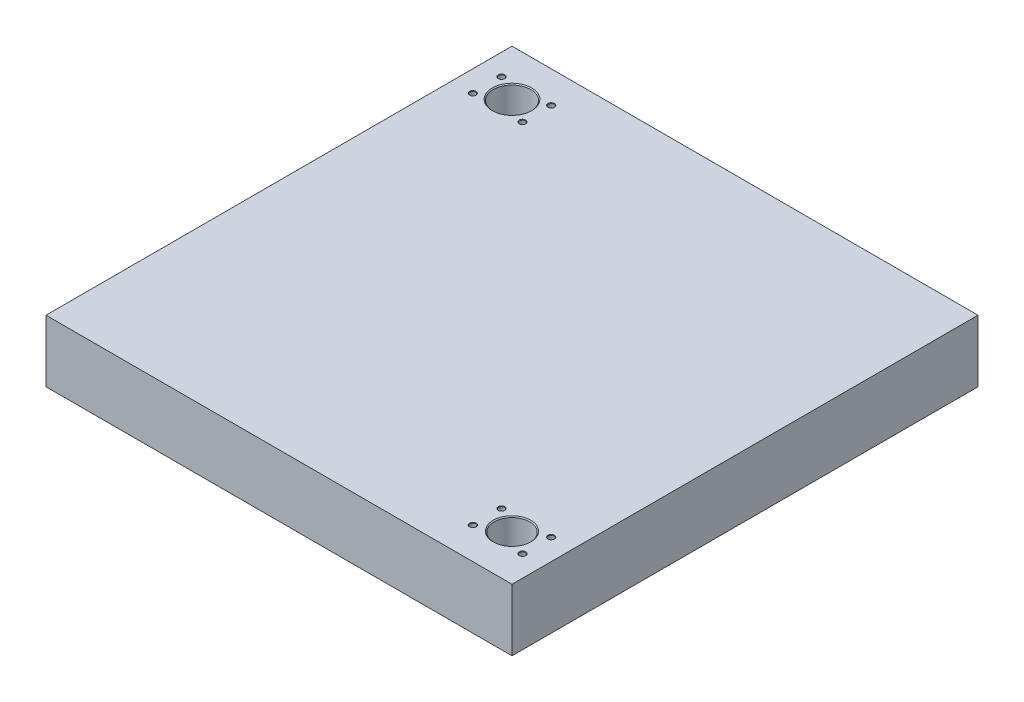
ISO-10303-21;
HEADER;
FILE_DESCRIPTION(('STEP AP214'),'2;1');
FILE_NAME('part.step','',(''),(''),'','','');
FILE_SCHEMA(('AUTOMOTIVE_DESIGN { 1 0 10303 214 1 1 1 1 }'));
ENDSEC;
DATA;
#1=APPLICATION_CONTEXT('core data for automotive mechanical design processes');
#2=APPLICATION_PROTOCOL_DEFINITION('international standard','automotive_design',2000,#1);
#3=PRODUCT_CONTEXT('',#1,'mechanical');
#4=PRODUCT('Part','Part','',(#3));
#5=PRODUCT_RELATED_PRODUCT_CATEGORY('part','',(#4));
#6=PRODUCT_DEFINITION_FORMATION('','',#4);
#7=PRODUCT_DEFINITION_CONTEXT('part definition',#1,'design');
#8=PRODUCT_DEFINITION('design','',#6,#7);
#9=PRODUCT_DEFINITION_SHAPE('','',#8);
#10=(LENGTH_UNIT() NAMED_UNIT(*) SI_UNIT(.MILLI.,.METRE.));
#11=(NAMED_UNIT(*) PLANE_ANGLE_UNIT() SI_UNIT($,.RADIAN.));
#12=(NAMED_UNIT(*) SI_UNIT($,.STERADIAN.) SOLID_ANGLE_UNIT());
#13=UNCERTAINTY_MEASURE_WITH_UNIT(LENGTH_MEASURE(1.E-05),#10,'distance_accuracy_value','');
#14=(GEOMETRIC_REPRESENTATION_CONTEXT(3) GLOBAL_UNCERTAINTY_ASSIGNED_CONTEXT((#13)) GLOBAL_UNIT_ASSIGNED_CONTEXT((#10,
#11,#12)) REPRESENTATION_CONTEXT('',''));
#15=CARTESIAN_POINT('',(0.,0.,0.));
#16=DIRECTION('',(0.,0.,1.));
#17=DIRECTION('',(1.,0.,0.));
#18=AXIS2_PLACEMENT_3D('',#15,#16,#17);
#19=CARTESIAN_POINT('',(0.,66.,0.));
#20=DIRECTION('',(0.,1.,0.));
#21=DIRECTION('',(0.,0.,1.));
#22=AXIS2_PLACEMENT_3D('',#19,#20,#21);
#23=PLANE('',#22);
#24=CARTESIAN_POINT('',(199.,66.,199.));
#25=DIRECTION('',(0.,1.,0.));
#26=DIRECTION('',(0.,0.,1.));
#27=AXIS2_PLACEMENT_3D('',#24,#25,#26);
#28=CIRCLE('',#27,20.);
#29=CARTESIAN_POINT('',(199.,66.,219.));
#30=VERTEX_POINT('',#29);
#31=EDGE_CURVE('E190',#30,#30,#28,.F.);
#32=ORIENTED_EDGE('',*,*,#31,.T.);
#33=EDGE_LOOP('',(#32));
#34=FACE_BOUND('',#33,.T.);
#35=CARTESIAN_POINT('',(-199.,66.,-199.));
#36=DIRECTION('',(0.,1.,0.));
#37=DIRECTION('',(0.,0.,1.));
#38=AXIS2_PLACEMENT_3D('',#35,#36,#37);
#39=CIRCLE('',#38,20.9999999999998);
#40=CARTESIAN_POINT('',(-199.,66.,-178.));
#41=VERTEX_POINT('',#40);
#42=EDGE_CURVE('E187',#41,#41,#39,.F.);
#43=ORIENTED_EDGE('',*,*,#42,.T.);
#44=EDGE_LOOP('',(#43));
#45=FACE_BOUND('',#44,.T.);
#46=CARTESIAN_POINT('',(-172.586225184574,66.,-183.75));
#47=DIRECTION('',(0.,1.,0.));
#48=DIRECTION('',(0.,0.,1.));
#49=AXIS2_PLACEMENT_3D('',#46,#47,#48);
#50=CIRCLE('',#49,3.49999999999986);
#51=CARTESIAN_POINT('',(-172.586225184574,66.,-180.25));
#52=VERTEX_POINT('',#51);
#53=EDGE_CURVE('E184',#52,#52,#50,.F.);
#54=ORIENTED_EDGE('',*,*,#53,.T.);
#55=EDGE_LOOP('',(#54));
#56=FACE_BOUND('',#55,.T.);
#57=CARTESIAN_POINT('',(-172.586225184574,66.,-214.25));
#58=DIRECTION('',(0.,1.,0.));
#59=DIRECTION('',(0.,0.,1.));
#60=AXIS2_PLACEMENT_3D('',#57,#58,#59);
#61=CIRCLE('',#60,3.49999999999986);
#62=CARTESIAN_POINT('',(-172.586225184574,66.,-210.75));
#63=VERTEX_POINT('',#62);
#64=EDGE_CURVE('E181',#63,#63,#61,.F.);
#65=ORIENTED_EDGE('',*,*,#64,.T.);
#66=EDGE_LOOP('',(#65));
#67=FACE_BOUND('',#66,.T.);
#68=CARTESIAN_POINT('',(-225.413774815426,66.,-183.75));
#69=DIRECTION('',(0.,1.,0.));
#70=DIRECTION('',(0.,0.,1.));
#71=AXIS2_PLACEMENT_3D('',#68,#69,#70);
#72=CIRCLE('',#71,3.49999999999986);
#73=CARTESIAN_POINT('',(-225.413774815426,66.,-180.25));
#74=VERTEX_POINT('',#73);
#75=EDGE_CURVE('E178',#74,#74,#72,.F.);
#76=ORIENTED_EDGE('',*,*,#75,.T.);
#77=EDGE_LOOP('',(#76));
#78=FACE_BOUND('',#77,.T.);
#79=CARTESIAN_POINT('',(-225.413774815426,66.,-214.25));
#80=DIRECTION('',(0.,1.,0.));
#81=DIRECTION('',(0.,0.,1.));
#82=AXIS2_PLACEMENT_3D('',#79,#80,#81);
#83=CIRCLE('',#82,3.49999999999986);
#84=CARTESIAN_POINT('',(-225.413774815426,66.,-210.75));
#85=VERTEX_POINT('',#84);
#86=EDGE_CURVE('E175',#85,#85,#83,.F.);
#87=ORIENTED_EDGE('',*,*,#86,.T.);
#88=EDGE_LOOP('',(#87));
#89=FACE_BOUND('',#88,.T.);
#90=CARTESIAN_POINT('',(172.586225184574,66.,214.25));
#91=DIRECTION('',(0.,1.,0.));
#92=DIRECTION('',(0.,0.,1.));
#93=AXIS2_PLACEMENT_3D('',#90,#91,#92);
#94=CIRCLE('',#93,3.49999999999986);
#95=CARTESIAN_POINT('',(172.586225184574,66.,217.75));
#96=VERTEX_POINT('',#95);
#97=EDGE_CURVE('E172',#96,#96,#94,.F.);
#98=ORIENTED_EDGE('',*,*,#97,.T.);
#99=EDGE_LOOP('',(#98));
#100=FACE_BOUND('',#99,.T.);
#101=CARTESIAN_POINT('',(225.413774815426,66.,214.25));
#102=DIRECTION('',(0.,1.,0.));
#103=DIRECTION('',(0.,0.,1.));
#104=AXIS2_PLACEMENT_3D('',#101,#102,#103);
#105=CIRCLE('',#104,3.49999999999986);
#106=CARTESIAN_POINT('',(225.413774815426,66.,217.75));
#107=VERTEX_POINT('',#106);
#108=EDGE_CURVE('E169',#107,#107,#105,.F.);
#109=ORIENTED_EDGE('',*,*,#108,.T.);
#110=EDGE_LOOP('',(#109));
#111=FACE_BOUND('',#110,.T.);
#112=CARTESIAN_POINT('',(225.413774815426,66.,183.75));
#113=DIRECTION('',(0.,1.,0.));
#114=DIRECTION('',(0.,0.,1.));
#115=AXIS2_PLACEMENT_3D('',#112,#113,#114);
#116=CIRCLE('',#115,3.49999999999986);
#117=CARTESIAN_POINT('',(225.413774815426,66.,187.25));
#118=VERTEX_POINT('',#117);
#119=EDGE_CURVE('E166',#118,#118,#116,.F.);
#120=ORIENTED_EDGE('',*,*,#119,.T.);
#121=EDGE_LOOP('',(#120));
#122=FACE_BOUND('',#121,.T.);
#123=CARTESIAN_POINT('',(172.586225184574,66.,183.75));
#124=DIRECTION('',(0.,1.,0.));
#125=DIRECTION('',(0.,0.,1.));
#126=AXIS2_PLACEMENT_3D('',#123,#124,#125);
#127=CIRCLE('',#126,3.49999999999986);
#128=CARTESIAN_POINT('',(172.586225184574,66.,187.25));
#129=VERTEX_POINT('',#128);
#130=EDGE_CURVE('E163',#129,#129,#127,.F.);
#131=ORIENTED_EDGE('',*,*,#130,.T.);
#132=EDGE_LOOP('',(#131));
#133=FACE_BOUND('',#132,.T.);
#134=DIRECTION('',(0.,0.,1.));
#135=VECTOR('',#134,1.);
#136=CARTESIAN_POINT('',(-248.,66.,248.));
#137=LINE('',#136,#135);
#138=CARTESIAN_POINT('',(-248.,66.,-248.));
#139=VERTEX_POINT('',#138);
#140=CARTESIAN_POINT('',(-248.,66.,248.));
#141=VERTEX_POINT('',#140);
#142=EDGE_CURVE('E131',#139,#141,#137,.T.);
#143=ORIENTED_EDGE('',*,*,#142,.T.);
#144=DIRECTION('',(1.,0.,0.));
#145=VECTOR('',#144,1.);
#146=CARTESIAN_POINT('',(248.,66.,248.));
#147=LINE('',#146,#145);
#148=CARTESIAN_POINT('',(248.,66.,248.));
#149=VERTEX_POINT('',#148);
#150=EDGE_CURVE('E67',#141,#149,#147,.T.);
#151=ORIENTED_EDGE('',*,*,#150,.T.);
#152=DIRECTION('',(0.,0.,-1.));
#153=VECTOR('',#152,1.);
#154=CARTESIAN_POINT('',(248.,66.,248.));
#155=LINE('',#154,#153);
#156=CARTESIAN_POINT('',(248.,66.,-248.));
#157=VERTEX_POINT('',#156);
#158=EDGE_CURVE('E134',#149,#157,#155,.T.);
#159=ORIENTED_EDGE('',*,*,#158,.T.);
#160=DIRECTION('',(-1.,0.,0.));
#161=VECTOR('',#160,1.);
#162=CARTESIAN_POINT('',(248.,66.,-248.));
#163=LINE('',#162,#161);
#164=EDGE_CURVE('E35',#157,#139,#163,.T.);
#165=ORIENTED_EDGE('',*,*,#164,.T.);
#166=EDGE_LOOP('',(#143,#151,#159,#165));
#167=FACE_BOUND('',#166,.T.);
#168=ADVANCED_FACE('F16',(#34,#45,#56,#67,#78,#89,#100,#111,#122,#133,#167),#23,.T.);
#169=CARTESIAN_POINT('',(0.,0.,0.));
#170=DIRECTION('',(0.,1.,0.));
#171=DIRECTION('',(0.,0.,1.));
#172=AXIS2_PLACEMENT_3D('',#169,#170,#171);
#173=PLANE('',#172);
#174=CARTESIAN_POINT('',(199.,0.,199.));
#175=DIRECTION('',(0.,1.,0.));
#176=DIRECTION('',(0.,0.,1.));
#177=AXIS2_PLACEMENT_3D('',#174,#175,#176);
#178=CIRCLE('',#177,20.);
#179=CARTESIAN_POINT('',(199.,0.,219.));
#180=VERTEX_POINT('',#179);
#181=EDGE_CURVE('E154',#180,#180,#178,.T.);
#182=ORIENTED_EDGE('',*,*,#181,.T.);
#183=EDGE_LOOP('',(#182));
#184=FACE_BOUND('',#183,.T.);
#185=CARTESIAN_POINT('',(-199.,0.,-199.));
#186=DIRECTION('',(0.,1.,0.));
#187=DIRECTION('',(0.,0.,1.));
#188=AXIS2_PLACEMENT_3D('',#185,#186,#187);
#189=CIRCLE('',#188,21.);
#190=CARTESIAN_POINT('',(-199.,0.,-178.));
#191=VERTEX_POINT('',#190);
#192=EDGE_CURVE('E151',#191,#191,#189,.T.);
#193=ORIENTED_EDGE('',*,*,#192,.T.);
#194=EDGE_LOOP('',(#193));
#195=FACE_BOUND('',#194,.T.);
#196=DIRECTION('',(0.,0.,1.));
#197=VECTOR('',#196,1.);
#198=CARTESIAN_POINT('',(-248.,0.,248.));
#199=LINE('',#198,#197);
#200=CARTESIAN_POINT('',(-248.,0.,-248.));
#201=VERTEX_POINT('',#200);
#202=CARTESIAN_POINT('',(-248.,0.,248.));
#203=VERTEX_POINT('',#202);
#204=EDGE_CURVE('E130',#201,#203,#199,.T.);
#205=ORIENTED_EDGE('',*,*,#204,.F.);
#206=DIRECTION('',(-1.,0.,0.));
#207=VECTOR('',#206,1.);
#208=CARTESIAN_POINT('',(248.,0.,-248.));
#209=LINE('',#208,#207);
#210=CARTESIAN_POINT('',(248.,0.,-248.));
#211=VERTEX_POINT('',#210);
#212=EDGE_CURVE('E59',#211,#201,#209,.T.);
#213=ORIENTED_EDGE('',*,*,#212,.F.);
#214=DIRECTION('',(0.,0.,-1.));
#215=VECTOR('',#214,1.);
#216=CARTESIAN_POINT('',(248.,0.,248.));
#217=LINE('',#216,#215);
#218=CARTESIAN_POINT('',(248.,0.,248.));
#219=VERTEX_POINT('',#218);
#220=EDGE_CURVE('E53',#219,#211,#217,.T.);
#221=ORIENTED_EDGE('',*,*,#220,.F.);
#222=DIRECTION('',(1.,0.,0.));
#223=VECTOR('',#222,1.);
#224=CARTESIAN_POINT('',(248.,0.,248.));
#225=LINE('',#224,#223);
#226=EDGE_CURVE('E140',#203,#219,#225,.T.);
#227=ORIENTED_EDGE('',*,*,#226,.F.);
#228=EDGE_LOOP('',(#205,#213,#221,#227));
#229=FACE_BOUND('',#228,.T.);
#230=ADVANCED_FACE('F262',(#184,#195,#229),#173,.F.);
#231=CARTESIAN_POINT('',(-248.,66.,248.));
#232=DIRECTION('',(1.,0.,0.));
#233=DIRECTION('',(0.,0.,-1.));
#234=AXIS2_PLACEMENT_3D('',#231,#232,#233);
#235=PLANE('',#234);
#236=ORIENTED_EDGE('',*,*,#204,.T.);
#237=DIRECTION('',(0.,-1.,0.));
#238=VECTOR('',#237,1.);
#239=CARTESIAN_POINT('',(-248.,66.,248.));
#240=LINE('',#239,#238);
#241=EDGE_CURVE('E149',#141,#203,#240,.T.);
#242=ORIENTED_EDGE('',*,*,#241,.F.);
#243=ORIENTED_EDGE('',*,*,#142,.F.);
#244=DIRECTION('',(0.,-1.,0.));
#245=VECTOR('',#244,1.);
#246=CARTESIAN_POINT('',(-248.,66.,-248.));
#247=LINE('',#246,#245);
#248=EDGE_CURVE('E137',#139,#201,#247,.T.);
#249=ORIENTED_EDGE('',*,*,#248,.T.);
#250=EDGE_LOOP('',(#236,#242,#243,#249));
#251=FACE_BOUND('',#250,.T.);
#252=ADVANCED_FACE('F269',(#251),#235,.F.);
#253=CARTESIAN_POINT('',(248.,66.,248.));
#254=DIRECTION('',(0.,0.,-1.));
#255=DIRECTION('',(-1.,0.,0.));
#256=AXIS2_PLACEMENT_3D('',#253,#254,#255);
#257=PLANE('',#256);
#258=ORIENTED_EDGE('',*,*,#226,.T.);
#259=DIRECTION('',(0.,-1.,0.));
#260=VECTOR('',#259,1.);
#261=CARTESIAN_POINT('',(248.,66.,248.));
#262=LINE('',#261,#260);
#263=EDGE_CURVE('E147',#149,#219,#262,.T.);
#264=ORIENTED_EDGE('',*,*,#263,.F.);
#265=ORIENTED_EDGE('',*,*,#150,.F.);
#266=ORIENTED_EDGE('',*,*,#241,.T.);
#267=EDGE_LOOP('',(#258,#264,#265,#266));
#268=FACE_BOUND('',#267,.T.);
#269=ADVANCED_FACE('F283',(#268),#257,.F.);
#270=CARTESIAN_POINT('',(248.,66.,248.));
#271=DIRECTION('',(-1.,0.,0.));
#272=DIRECTION('',(0.,0.,1.));
#273=AXIS2_PLACEMENT_3D('',#270,#271,#272);
#274=PLANE('',#273);
#275=ORIENTED_EDGE('',*,*,#220,.T.);
#276=DIRECTION('',(0.,-1.,0.));
#277=VECTOR('',#276,1.);
#278=CARTESIAN_POINT('',(248.,66.,-248.));
#279=LINE('',#278,#277);
#280=EDGE_CURVE('E145',#157,#211,#279,.T.);
#281=ORIENTED_EDGE('',*,*,#280,.F.);
#282=ORIENTED_EDGE('',*,*,#158,.F.);
#283=ORIENTED_EDGE('',*,*,#263,.T.);
#284=EDGE_LOOP('',(#275,#281,#282,#283));
#285=FACE_BOUND('',#284,.T.);
#286=ADVANCED_FACE('F280',(#285),#274,.F.);
#287=CARTESIAN_POINT('',(248.,66.,-248.));
#288=DIRECTION('',(0.,0.,1.));
#289=DIRECTION('',(1.,0.,0.));
#290=AXIS2_PLACEMENT_3D('',#287,#288,#289);
#291=PLANE('',#290);
#292=ORIENTED_EDGE('',*,*,#212,.T.);
#293=ORIENTED_EDGE('',*,*,#248,.F.);
#294=ORIENTED_EDGE('',*,*,#164,.F.);
#295=ORIENTED_EDGE('',*,*,#280,.T.);
#296=EDGE_LOOP('',(#292,#293,#294,#295));
#297=FACE_BOUND('',#296,.T.);
#298=ADVANCED_FACE('F277',(#297),#291,.F.);
#299=CARTESIAN_POINT('',(-199.,66.,-199.));
#300=DIRECTION('',(0.,-1.,0.));
#301=DIRECTION('',(0.,0.,-1.));
#302=AXIS2_PLACEMENT_3D('',#299,#300,#301);
#303=CYLINDRICAL_SURFACE('',#302,20.);
#304=CARTESIAN_POINT('',(-199.,0.999999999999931,-199.));
#305=DIRECTION('',(0.,1.,0.));
#306=DIRECTION('',(0.,0.,1.));
#307=AXIS2_PLACEMENT_3D('',#304,#305,#306);
#308=CIRCLE('',#307,20.);
#309=CARTESIAN_POINT('',(-199.,0.999999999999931,-179.));
#310=VERTEX_POINT('',#309);
#311=EDGE_CURVE('E10',#310,#310,#308,.F.);
#312=ORIENTED_EDGE('',*,*,#311,.T.);
#313=EDGE_LOOP('',(#312));
#314=FACE_BOUND('',#313,.T.);
#315=CARTESIAN_POINT('',(-199.,65.,-199.));
#316=DIRECTION('',(0.,1.,0.));
#317=DIRECTION('',(0.,0.,1.));
#318=AXIS2_PLACEMENT_3D('',#315,#316,#317);
#319=CIRCLE('',#318,20.);
#320=CARTESIAN_POINT('',(-199.,65.,-179.));
#321=VERTEX_POINT('',#320);
#322=EDGE_CURVE('E26',#321,#321,#319,.T.);
#323=ORIENTED_EDGE('',*,*,#322,.T.);
#324=EDGE_LOOP('',(#323));
#325=FACE_BOUND('',#324,.T.);
#326=ADVANCED_FACE('F274',(#314,#325),#303,.F.);
#327=CARTESIAN_POINT('',(199.,66.,199.));
#328=DIRECTION('',(0.,-1.,0.));
#329=DIRECTION('',(0.,0.,-1.));
#330=AXIS2_PLACEMENT_3D('',#327,#328,#329);
#331=CYLINDRICAL_SURFACE('',#330,19.);
#332=CARTESIAN_POINT('',(199.,0.999999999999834,199.));
#333=DIRECTION('',(0.,1.,0.));
#334=DIRECTION('',(0.,0.,1.));
#335=AXIS2_PLACEMENT_3D('',#332,#333,#334);
#336=CIRCLE('',#335,19.);
#337=CARTESIAN_POINT('',(199.,0.999999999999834,218.));
#338=VERTEX_POINT('',#337);
#339=EDGE_CURVE('E160',#338,#338,#336,.F.);
#340=ORIENTED_EDGE('',*,*,#339,.T.);
#341=EDGE_LOOP('',(#340));
#342=FACE_BOUND('',#341,.T.);
#343=CARTESIAN_POINT('',(199.,65.,199.));
#344=DIRECTION('',(0.,1.,0.));
#345=DIRECTION('',(0.,0.,1.));
#346=AXIS2_PLACEMENT_3D('',#343,#344,#345);
#347=CIRCLE('',#346,19.);
#348=CARTESIAN_POINT('',(199.,65.,218.));
#349=VERTEX_POINT('',#348);
#350=EDGE_CURVE('E157',#349,#349,#347,.T.);
#351=ORIENTED_EDGE('',*,*,#350,.T.);
#352=EDGE_LOOP('',(#351));
#353=FACE_BOUND('',#352,.T.);
#354=ADVANCED_FACE('F293',(#342,#353),#331,.F.);
#355=CARTESIAN_POINT('',(199.,0.,199.));
#356=DIRECTION('',(0.,-1.,0.));
#357=DIRECTION('',(0.,0.,-1.));
#358=AXIS2_PLACEMENT_3D('',#355,#356,#357);
#359=CONICAL_SURFACE('',#358,20.,0.785398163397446);
#360=ORIENTED_EDGE('',*,*,#339,.F.);
#361=EDGE_LOOP('',(#360));
#362=FACE_BOUND('',#361,.T.);
#363=ORIENTED_EDGE('',*,*,#181,.F.);
#364=EDGE_LOOP('',(#363));
#365=FACE_BOUND('',#364,.T.);
#366=ADVANCED_FACE('F289',(#362,#365),#359,.F.);
#367=CARTESIAN_POINT('',(199.,65.,199.));
#368=DIRECTION('',(0.,1.,0.));
#369=DIRECTION('',(0.,0.,1.));
#370=AXIS2_PLACEMENT_3D('',#367,#368,#369);
#371=CONICAL_SURFACE('',#370,19.,0.785398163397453);
#372=ORIENTED_EDGE('',*,*,#31,.F.);
#373=EDGE_LOOP('',(#372));
#374=FACE_BOUND('',#373,.T.);
#375=ORIENTED_EDGE('',*,*,#350,.F.);
#376=EDGE_LOOP('',(#375));
#377=FACE_BOUND('',#376,.T.);
#378=ADVANCED_FACE('F292',(#374,#377),#371,.F.);
#379=CARTESIAN_POINT('',(-199.,0.,-199.));
#380=DIRECTION('',(0.,-1.,0.));
#381=DIRECTION('',(0.,0.,-1.));
#382=AXIS2_PLACEMENT_3D('',#379,#380,#381);
#383=CONICAL_SURFACE('',#382,21.,0.785398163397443);
#384=ORIENTED_EDGE('',*,*,#311,.F.);
#385=EDGE_LOOP('',(#384));
#386=FACE_BOUND('',#385,.T.);
#387=ORIENTED_EDGE('',*,*,#192,.F.);
#388=EDGE_LOOP('',(#387));
#389=FACE_BOUND('',#388,.T.);
#390=ADVANCED_FACE('F297',(#386,#389),#383,.F.);
#391=CARTESIAN_POINT('',(-199.,65.,-199.));
#392=DIRECTION('',(0.,1.,0.));
#393=DIRECTION('',(0.,0.,1.));
#394=AXIS2_PLACEMENT_3D('',#391,#392,#393);
#395=CONICAL_SURFACE('',#394,20.,0.785398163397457);
#396=ORIENTED_EDGE('',*,*,#42,.F.);
#397=EDGE_LOOP('',(#396));
#398=FACE_BOUND('',#397,.T.);
#399=ORIENTED_EDGE('',*,*,#322,.F.);
#400=EDGE_LOOP('',(#399));
#401=FACE_BOUND('',#400,.T.);
#402=ADVANCED_FACE('F301',(#398,#401),#395,.F.);
#403=CARTESIAN_POINT('',(-172.586225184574,65.,-183.75));
#404=DIRECTION('',(0.,1.,0.));
#405=DIRECTION('',(0.,0.,1.));
#406=AXIS2_PLACEMENT_3D('',#403,#404,#405);
#407=CONICAL_SURFACE('',#406,2.5,0.785398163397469);
#408=CARTESIAN_POINT('',(-172.586225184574,65.5,-183.75));
#409=DIRECTION('',(0.,1.,0.));
#410=DIRECTION('',(0.,0.,1.));
#411=AXIS2_PLACEMENT_3D('',#408,#409,#410);
#412=CIRCLE('',#411,3.);
#413=CARTESIAN_POINT('',(-172.586225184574,65.5,-180.75));
#414=VERTEX_POINT('',#413);
#415=EDGE_CURVE('E216',#414,#414,#412,.T.);
#416=ORIENTED_EDGE('',*,*,#415,.F.);
#417=EDGE_LOOP('',(#416));
#418=FACE_BOUND('',#417,.T.);
#419=ORIENTED_EDGE('',*,*,#53,.F.);
#420=EDGE_LOOP('',(#419));
#421=FACE_BOUND('',#420,.T.);
#422=ADVANCED_FACE('F305',(#418,#421),#407,.F.);
#423=CARTESIAN_POINT('',(-172.586225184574,65.,-214.25));
#424=DIRECTION('',(0.,1.,0.));
#425=DIRECTION('',(0.,0.,1.));
#426=AXIS2_PLACEMENT_3D('',#423,#424,#425);
#427=CONICAL_SURFACE('',#426,2.5,0.785398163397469);
#428=CARTESIAN_POINT('',(-172.586225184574,65.5,-214.25));
#429=DIRECTION('',(0.,1.,0.));
#430=DIRECTION('',(0.,0.,1.));
#431=AXIS2_PLACEMENT_3D('',#428,#429,#430);
#432=CIRCLE('',#431,3.);
#433=CARTESIAN_POINT('',(-172.586225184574,65.5,-211.25));
#434=VERTEX_POINT('',#433);
#435=EDGE_CURVE('E213',#434,#434,#432,.T.);
#436=ORIENTED_EDGE('',*,*,#435,.F.);
#437=EDGE_LOOP('',(#436));
#438=FACE_BOUND('',#437,.T.);
#439=ORIENTED_EDGE('',*,*,#64,.F.);
#440=EDGE_LOOP('',(#439));
#441=FACE_BOUND('',#440,.T.);
#442=ADVANCED_FACE('F309',(#438,#441),#427,.F.);
#443=CARTESIAN_POINT('',(-225.413774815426,65.,-183.75));
#444=DIRECTION('',(0.,1.,0.));
#445=DIRECTION('',(0.,0.,1.));
#446=AXIS2_PLACEMENT_3D('',#443,#444,#445);
#447=CONICAL_SURFACE('',#446,2.5,0.785398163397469);
#448=CARTESIAN_POINT('',(-225.413774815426,65.5,-183.75));
#449=DIRECTION('',(0.,1.,0.));
#450=DIRECTION('',(0.,0.,1.));
#451=AXIS2_PLACEMENT_3D('',#448,#449,#450);
#452=CIRCLE('',#451,3.);
#453=CARTESIAN_POINT('',(-225.413774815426,65.5,-180.75));
#454=VERTEX_POINT('',#453);
#455=EDGE_CURVE('E210',#454,#454,#452,.T.);
#456=ORIENTED_EDGE('',*,*,#455,.F.);
#457=EDGE_LOOP('',(#456));
#458=FACE_BOUND('',#457,.T.);
#459=ORIENTED_EDGE('',*,*,#75,.F.);
#460=EDGE_LOOP('',(#459));
#461=FACE_BOUND('',#460,.T.);
#462=ADVANCED_FACE('F313',(#458,#461),#447,.F.);
#463=CARTESIAN_POINT('',(-225.413774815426,65.,-214.25));
#464=DIRECTION('',(0.,1.,0.));
#465=DIRECTION('',(0.,0.,1.));
#466=AXIS2_PLACEMENT_3D('',#463,#464,#465);
#467=CONICAL_SURFACE('',#466,2.5,0.785398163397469);
#468=CARTESIAN_POINT('',(-225.413774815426,65.5,-214.25));
#469=DIRECTION('',(0.,1.,0.));
#470=DIRECTION('',(0.,0.,1.));
#471=AXIS2_PLACEMENT_3D('',#468,#469,#470);
#472=CIRCLE('',#471,3.);
#473=CARTESIAN_POINT('',(-225.413774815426,65.5,-211.25));
#474=VERTEX_POINT('',#473);
#475=EDGE_CURVE('E207',#474,#474,#472,.T.);
#476=ORIENTED_EDGE('',*,*,#475,.F.);
#477=EDGE_LOOP('',(#476));
#478=FACE_BOUND('',#477,.T.);
#479=ORIENTED_EDGE('',*,*,#86,.F.);
#480=EDGE_LOOP('',(#479));
#481=FACE_BOUND('',#480,.T.);
#482=ADVANCED_FACE('F317',(#478,#481),#467,.F.);
#483=CARTESIAN_POINT('',(172.586225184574,65.,214.25));
#484=DIRECTION('',(0.,1.,0.));
#485=DIRECTION('',(0.,0.,1.));
#486=AXIS2_PLACEMENT_3D('',#483,#484,#485);
#487=CONICAL_SURFACE('',#486,2.5,0.785398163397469);
#488=CARTESIAN_POINT('',(172.586225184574,65.5,214.25));
#489=DIRECTION('',(0.,1.,0.));
#490=DIRECTION('',(0.,0.,1.));
#491=AXIS2_PLACEMENT_3D('',#488,#489,#490);
#492=CIRCLE('',#491,3.);
#493=CARTESIAN_POINT('',(172.586225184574,65.5,217.25));
#494=VERTEX_POINT('',#493);
#495=EDGE_CURVE('E204',#494,#494,#492,.T.);
#496=ORIENTED_EDGE('',*,*,#495,.F.);
#497=EDGE_LOOP('',(#496));
#498=FACE_BOUND('',#497,.T.);
#499=ORIENTED_EDGE('',*,*,#97,.F.);
#500=EDGE_LOOP('',(#499));
#501=FACE_BOUND('',#500,.T.);
#502=ADVANCED_FACE('F321',(#498,#501),#487,.F.);
#503=CARTESIAN_POINT('',(225.413774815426,65.,214.25));
#504=DIRECTION('',(0.,1.,0.));
#505=DIRECTION('',(0.,0.,1.));
#506=AXIS2_PLACEMENT_3D('',#503,#504,#505);
#507=CONICAL_SURFACE('',#506,2.5,0.785398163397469);
#508=CARTESIAN_POINT('',(225.413774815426,65.5,214.25));
#509=DIRECTION('',(0.,1.,0.));
#510=DIRECTION('',(0.,0.,1.));
#511=AXIS2_PLACEMENT_3D('',#508,#509,#510);
#512=CIRCLE('',#511,3.);
#513=CARTESIAN_POINT('',(225.413774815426,65.5,217.25));
#514=VERTEX_POINT('',#513);
#515=EDGE_CURVE('E201',#514,#514,#512,.T.);
#516=ORIENTED_EDGE('',*,*,#515,.F.);
#517=EDGE_LOOP('',(#516));
#518=FACE_BOUND('',#517,.T.);
#519=ORIENTED_EDGE('',*,*,#108,.F.);
#520=EDGE_LOOP('',(#519));
#521=FACE_BOUND('',#520,.T.);
#522=ADVANCED_FACE('F325',(#518,#521),#507,.F.);
#523=CARTESIAN_POINT('',(225.413774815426,65.,183.75));
#524=DIRECTION('',(0.,1.,0.));
#525=DIRECTION('',(0.,0.,1.));
#526=AXIS2_PLACEMENT_3D('',#523,#524,#525);
#527=CONICAL_SURFACE('',#526,2.5,0.785398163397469);
#528=CARTESIAN_POINT('',(225.413774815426,65.5,183.75));
#529=DIRECTION('',(0.,1.,0.));
#530=DIRECTION('',(0.,0.,1.));
#531=AXIS2_PLACEMENT_3D('',#528,#529,#530);
#532=CIRCLE('',#531,3.);
#533=CARTESIAN_POINT('',(225.413774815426,65.5,186.75));
#534=VERTEX_POINT('',#533);
#535=EDGE_CURVE('E198',#534,#534,#532,.T.);
#536=ORIENTED_EDGE('',*,*,#535,.F.);
#537=EDGE_LOOP('',(#536));
#538=FACE_BOUND('',#537,.T.);
#539=ORIENTED_EDGE('',*,*,#119,.F.);
#540=EDGE_LOOP('',(#539));
#541=FACE_BOUND('',#540,.T.);
#542=ADVANCED_FACE('F328',(#538,#541),#527,.F.);
#543=CARTESIAN_POINT('',(172.586225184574,65.,183.75));
#544=DIRECTION('',(0.,1.,0.));
#545=DIRECTION('',(0.,0.,1.));
#546=AXIS2_PLACEMENT_3D('',#543,#544,#545);
#547=CONICAL_SURFACE('',#546,2.5,0.785398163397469);
#548=CARTESIAN_POINT('',(172.586225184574,65.5,183.75));
#549=DIRECTION('',(0.,1.,0.));
#550=DIRECTION('',(0.,0.,1.));
#551=AXIS2_PLACEMENT_3D('',#548,#549,#550);
#552=CIRCLE('',#551,3.);
#553=CARTESIAN_POINT('',(172.586225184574,65.5,186.75));
#554=VERTEX_POINT('',#553);
#555=EDGE_CURVE('E195',#554,#554,#552,.T.);
#556=ORIENTED_EDGE('',*,*,#555,.F.);
#557=EDGE_LOOP('',(#556));
#558=FACE_BOUND('',#557,.T.);
#559=ORIENTED_EDGE('',*,*,#130,.F.);
#560=EDGE_LOOP('',(#559));
#561=FACE_BOUND('',#560,.T.);
#562=ADVANCED_FACE('F18',(#558,#561),#547,.F.);
#563=CARTESIAN_POINT('',(172.586225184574,51.,183.75));
#564=DIRECTION('',(0.,1.,0.));
#565=DIRECTION('',(0.,0.,1.));
#566=AXIS2_PLACEMENT_3D('',#563,#564,#565);
#567=PLANE('',#566);
#568=CARTESIAN_POINT('',(172.586225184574,51.,183.75));
#569=DIRECTION('',(0.,1.,0.));
#570=DIRECTION('',(0.,0.,1.));
#571=AXIS2_PLACEMENT_3D('',#568,#569,#570);
#572=CIRCLE('',#571,3.);
#573=CARTESIAN_POINT('',(172.586225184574,51.,186.75));
#574=VERTEX_POINT('',#573);
#575=EDGE_CURVE('E361',#574,#574,#572,.T.);
#576=ORIENTED_EDGE('',*,*,#575,.T.);
#577=EDGE_LOOP('',(#576));
#578=FACE_BOUND('',#577,.T.);
#579=CARTESIAN_POINT('',(172.586225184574,51.,183.75));
#580=DIRECTION('',(0.,1.,0.));
#581=DIRECTION('',(0.,0.,1.));
#582=AXIS2_PLACEMENT_3D('',#579,#580,#581);
#583=CIRCLE('',#582,2.5);
#584=CARTESIAN_POINT('',(172.586225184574,51.,186.25));
#585=VERTEX_POINT('',#584);
#586=EDGE_CURVE('E231',#585,#585,#583,.F.);
#587=ORIENTED_EDGE('',*,*,#586,.T.);
#588=EDGE_LOOP('',(#587));
#589=FACE_BOUND('',#588,.T.);
#590=ADVANCED_FACE('F336',(#578,#589),#567,.T.);
#591=CARTESIAN_POINT('',(172.586225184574,51.,183.75));
#592=DIRECTION('',(0.,1.,0.));
#593=DIRECTION('',(0.,0.,1.));
#594=AXIS2_PLACEMENT_3D('',#591,#592,#593);
#595=CYLINDRICAL_SURFACE('',#594,3.);
#596=ORIENTED_EDGE('',*,*,#555,.T.);
#597=EDGE_LOOP('',(#596));
#598=FACE_BOUND('',#597,.T.);
#599=ORIENTED_EDGE('',*,*,#575,.F.);
#600=EDGE_LOOP('',(#599));
#601=FACE_BOUND('',#600,.T.);
#602=ADVANCED_FACE('F412',(#598,#601),#595,.F.);
#603=CARTESIAN_POINT('',(225.413774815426,51.,183.75));
#604=DIRECTION('',(0.,1.,0.));
#605=DIRECTION('',(0.,0.,1.));
#606=AXIS2_PLACEMENT_3D('',#603,#604,#605);
#607=PLANE('',#606);
#608=CARTESIAN_POINT('',(225.413774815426,51.,183.75));
#609=DIRECTION('',(0.,1.,0.));
#610=DIRECTION('',(0.,0.,1.));
#611=AXIS2_PLACEMENT_3D('',#608,#609,#610);
#612=CIRCLE('',#611,3.);
#613=CARTESIAN_POINT('',(225.413774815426,51.,186.75));
#614=VERTEX_POINT('',#613);
#615=EDGE_CURVE('E358',#614,#614,#612,.T.);
#616=ORIENTED_EDGE('',*,*,#615,.T.);
#617=EDGE_LOOP('',(#616));
#618=FACE_BOUND('',#617,.T.);
#619=CARTESIAN_POINT('',(225.413774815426,51.,183.75));
#620=DIRECTION('',(0.,1.,0.));
#621=DIRECTION('',(0.,0.,1.));
#622=AXIS2_PLACEMENT_3D('',#619,#620,#621);
#623=CIRCLE('',#622,2.5);
#624=CARTESIAN_POINT('',(225.413774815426,51.,186.25));
#625=VERTEX_POINT('',#624);
#626=EDGE_CURVE('E234',#625,#625,#623,.F.);
#627=ORIENTED_EDGE('',*,*,#626,.T.);
#628=EDGE_LOOP('',(#627));
#629=FACE_BOUND('',#628,.T.);
#630=ADVANCED_FACE('F354',(#618,#629),#607,.T.);
#631=CARTESIAN_POINT('',(225.413774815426,51.,183.75));
#632=DIRECTION('',(0.,1.,0.));
#633=DIRECTION('',(0.,0.,1.));
#634=AXIS2_PLACEMENT_3D('',#631,#632,#633);
#635=CYLINDRICAL_SURFACE('',#634,3.);
#636=ORIENTED_EDGE('',*,*,#535,.T.);
#637=EDGE_LOOP('',(#636));
#638=FACE_BOUND('',#637,.T.);
#639=ORIENTED_EDGE('',*,*,#615,.F.);
#640=EDGE_LOOP('',(#639));
#641=FACE_BOUND('',#640,.T.);
#642=ADVANCED_FACE('F351',(#638,#641),#635,.F.);
#643=CARTESIAN_POINT('',(225.413774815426,51.,214.25));
#644=DIRECTION('',(0.,1.,0.));
#645=DIRECTION('',(0.,0.,1.));
#646=AXIS2_PLACEMENT_3D('',#643,#644,#645);
#647=PLANE('',#646);
#648=CARTESIAN_POINT('',(225.413774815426,51.,214.25));
#649=DIRECTION('',(0.,1.,0.));
#650=DIRECTION('',(0.,0.,1.));
#651=AXIS2_PLACEMENT_3D('',#648,#649,#650);
#652=CIRCLE('',#651,3.);
#653=CARTESIAN_POINT('',(225.413774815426,51.,217.25));
#654=VERTEX_POINT('',#653);
#655=EDGE_CURVE('E360',#654,#654,#652,.T.);
#656=ORIENTED_EDGE('',*,*,#655,.T.);
#657=EDGE_LOOP('',(#656));
#658=FACE_BOUND('',#657,.T.);
#659=CARTESIAN_POINT('',(225.413774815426,51.,214.25));
#660=DIRECTION('',(0.,1.,0.));
#661=DIRECTION('',(0.,0.,1.));
#662=AXIS2_PLACEMENT_3D('',#659,#660,#661);
#663=CIRCLE('',#662,2.5);
#664=CARTESIAN_POINT('',(225.413774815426,51.,216.75));
#665=VERTEX_POINT('',#664);
#666=EDGE_CURVE('E108',#665,#665,#663,.F.);
#667=ORIENTED_EDGE('',*,*,#666,.T.);
#668=EDGE_LOOP('',(#667));
#669=FACE_BOUND('',#668,.T.);
#670=ADVANCED_FACE('F239',(#658,#669),#647,.T.);
#671=CARTESIAN_POINT('',(225.413774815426,51.,214.25));
#672=DIRECTION('',(0.,1.,0.));
#673=DIRECTION('',(0.,0.,1.));
#674=AXIS2_PLACEMENT_3D('',#671,#672,#673);
#675=CYLINDRICAL_SURFACE('',#674,3.);
#676=ORIENTED_EDGE('',*,*,#515,.T.);
#677=EDGE_LOOP('',(#676));
#678=FACE_BOUND('',#677,.T.);
#679=ORIENTED_EDGE('',*,*,#655,.F.);
#680=EDGE_LOOP('',(#679));
#681=FACE_BOUND('',#680,.T.);
#682=ADVANCED_FACE('F405',(#678,#681),#675,.F.);
#683=CARTESIAN_POINT('',(172.586225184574,51.,214.25));
#684=DIRECTION('',(0.,1.,0.));
#685=DIRECTION('',(0.,0.,1.));
#686=AXIS2_PLACEMENT_3D('',#683,#684,#685);
#687=PLANE('',#686);
#688=CARTESIAN_POINT('',(172.586225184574,51.,214.25));
#689=DIRECTION('',(0.,1.,0.));
#690=DIRECTION('',(0.,0.,1.));
#691=AXIS2_PLACEMENT_3D('',#688,#689,#690);
#692=CIRCLE('',#691,3.);
#693=CARTESIAN_POINT('',(172.586225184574,51.,217.25));
#694=VERTEX_POINT('',#693);
#695=EDGE_CURVE('E110',#694,#694,#692,.T.);
#696=ORIENTED_EDGE('',*,*,#695,.T.);
#697=EDGE_LOOP('',(#696));
#698=FACE_BOUND('',#697,.T.);
#699=CARTESIAN_POINT('',(172.586225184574,51.,214.25));
#700=DIRECTION('',(0.,1.,0.));
#701=DIRECTION('',(0.,0.,1.));
#702=AXIS2_PLACEMENT_3D('',#699,#700,#701);
#703=CIRCLE('',#702,2.5);
#704=CARTESIAN_POINT('',(172.586225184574,51.,216.75));
#705=VERTEX_POINT('',#704);
#706=EDGE_CURVE('E20',#705,#705,#703,.F.);
#707=ORIENTED_EDGE('',*,*,#706,.T.);
#708=EDGE_LOOP('',(#707));
#709=FACE_BOUND('',#708,.T.);
#710=ADVANCED_FACE('F409',(#698,#709),#687,.T.);
#711=CARTESIAN_POINT('',(172.586225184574,51.,214.25));
#712=DIRECTION('',(0.,1.,0.));
#713=DIRECTION('',(0.,0.,1.));
#714=AXIS2_PLACEMENT_3D('',#711,#712,#713);
#715=CYLINDRICAL_SURFACE('',#714,3.);
#716=ORIENTED_EDGE('',*,*,#495,.T.);
#717=EDGE_LOOP('',(#716));
#718=FACE_BOUND('',#717,.T.);
#719=ORIENTED_EDGE('',*,*,#695,.F.);
#720=EDGE_LOOP('',(#719));
#721=FACE_BOUND('',#720,.T.);
#722=ADVANCED_FACE('F399',(#718,#721),#715,.F.);
#723=CARTESIAN_POINT('',(-225.413774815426,51.,-214.25));
#724=DIRECTION('',(0.,1.,0.));
#725=DIRECTION('',(0.,0.,1.));
#726=AXIS2_PLACEMENT_3D('',#723,#724,#725);
#727=PLANE('',#726);
#728=CARTESIAN_POINT('',(-225.413774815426,51.,-214.25));
#729=DIRECTION('',(0.,1.,0.));
#730=DIRECTION('',(0.,0.,1.));
#731=AXIS2_PLACEMENT_3D('',#728,#729,#730);
#732=CIRCLE('',#731,3.);
#733=CARTESIAN_POINT('',(-225.413774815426,51.,-211.25));
#734=VERTEX_POINT('',#733);
#735=EDGE_CURVE('E379',#734,#734,#732,.T.);
#736=ORIENTED_EDGE('',*,*,#735,.T.);
#737=EDGE_LOOP('',(#736));
#738=FACE_BOUND('',#737,.T.);
#739=CARTESIAN_POINT('',(-225.413774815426,51.,-214.25));
#740=DIRECTION('',(0.,1.,0.));
#741=DIRECTION('',(0.,0.,1.));
#742=AXIS2_PLACEMENT_3D('',#739,#740,#741);
#743=CIRCLE('',#742,2.5);
#744=CARTESIAN_POINT('',(-225.413774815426,51.,-211.75));
#745=VERTEX_POINT('',#744);
#746=EDGE_CURVE('E219',#745,#745,#743,.F.);
#747=ORIENTED_EDGE('',*,*,#746,.T.);
#748=EDGE_LOOP('',(#747));
#749=FACE_BOUND('',#748,.T.);
#750=ADVANCED_FACE('F384',(#738,#749),#727,.T.);
#751=CARTESIAN_POINT('',(-225.413774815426,51.,-214.25));
#752=DIRECTION('',(0.,1.,0.));
#753=DIRECTION('',(0.,0.,1.));
#754=AXIS2_PLACEMENT_3D('',#751,#752,#753);
#755=CYLINDRICAL_SURFACE('',#754,3.);
#756=ORIENTED_EDGE('',*,*,#475,.T.);
#757=EDGE_LOOP('',(#756));
#758=FACE_BOUND('',#757,.T.);
#759=ORIENTED_EDGE('',*,*,#735,.F.);
#760=EDGE_LOOP('',(#759));
#761=FACE_BOUND('',#760,.T.);
#762=ADVANCED_FACE('F387',(#758,#761),#755,.F.);
#763=CARTESIAN_POINT('',(-225.413774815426,51.,-183.75));
#764=DIRECTION('',(0.,1.,0.));
#765=DIRECTION('',(0.,0.,1.));
#766=AXIS2_PLACEMENT_3D('',#763,#764,#765);
#767=PLANE('',#766);
#768=CARTESIAN_POINT('',(-225.413774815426,51.,-183.75));
#769=DIRECTION('',(0.,1.,0.));
#770=DIRECTION('',(0.,0.,1.));
#771=AXIS2_PLACEMENT_3D('',#768,#769,#770);
#772=CIRCLE('',#771,3.);
#773=CARTESIAN_POINT('',(-225.413774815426,51.,-180.75));
#774=VERTEX_POINT('',#773);
#775=EDGE_CURVE('E366',#774,#774,#772,.T.);
#776=ORIENTED_EDGE('',*,*,#775,.T.);
#777=EDGE_LOOP('',(#776));
#778=FACE_BOUND('',#777,.T.);
#779=CARTESIAN_POINT('',(-225.413774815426,51.,-183.75));
#780=DIRECTION('',(0.,1.,0.));
#781=DIRECTION('',(0.,0.,1.));
#782=AXIS2_PLACEMENT_3D('',#779,#780,#781);
#783=CIRCLE('',#782,2.5);
#784=CARTESIAN_POINT('',(-225.413774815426,51.,-181.25));
#785=VERTEX_POINT('',#784);
#786=EDGE_CURVE('E228',#785,#785,#783,.F.);
#787=ORIENTED_EDGE('',*,*,#786,.T.);
#788=EDGE_LOOP('',(#787));
#789=FACE_BOUND('',#788,.T.);
#790=ADVANCED_FACE('F389',(#778,#789),#767,.T.);
#791=CARTESIAN_POINT('',(-225.413774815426,51.,-183.75));
#792=DIRECTION('',(0.,1.,0.));
#793=DIRECTION('',(0.,0.,1.));
#794=AXIS2_PLACEMENT_3D('',#791,#792,#793);
#795=CYLINDRICAL_SURFACE('',#794,3.);
#796=ORIENTED_EDGE('',*,*,#455,.T.);
#797=EDGE_LOOP('',(#796));
#798=FACE_BOUND('',#797,.T.);
#799=ORIENTED_EDGE('',*,*,#775,.F.);
#800=EDGE_LOOP('',(#799));
#801=FACE_BOUND('',#800,.T.);
#802=ADVANCED_FACE('F397',(#798,#801),#795,.F.);
#803=CARTESIAN_POINT('',(-172.586225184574,51.,-214.25));
#804=DIRECTION('',(0.,1.,0.));
#805=DIRECTION('',(0.,0.,1.));
#806=AXIS2_PLACEMENT_3D('',#803,#804,#805);
#807=PLANE('',#806);
#808=CARTESIAN_POINT('',(-172.586225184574,51.,-214.25));
#809=DIRECTION('',(0.,1.,0.));
#810=DIRECTION('',(0.,0.,1.));
#811=AXIS2_PLACEMENT_3D('',#808,#809,#810);
#812=CIRCLE('',#811,3.);
#813=CARTESIAN_POINT('',(-172.586225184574,51.,-211.25));
#814=VERTEX_POINT('',#813);
#815=EDGE_CURVE('E374',#814,#814,#812,.T.);
#816=ORIENTED_EDGE('',*,*,#815,.T.);
#817=EDGE_LOOP('',(#816));
#818=FACE_BOUND('',#817,.T.);
#819=CARTESIAN_POINT('',(-172.586225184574,51.,-214.25));
#820=DIRECTION('',(0.,1.,0.));
#821=DIRECTION('',(0.,0.,1.));
#822=AXIS2_PLACEMENT_3D('',#819,#820,#821);
#823=CIRCLE('',#822,2.5);
#824=CARTESIAN_POINT('',(-172.586225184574,51.,-211.75));
#825=VERTEX_POINT('',#824);
#826=EDGE_CURVE('E222',#825,#825,#823,.F.);
#827=ORIENTED_EDGE('',*,*,#826,.T.);
#828=EDGE_LOOP('',(#827));
#829=FACE_BOUND('',#828,.T.);
#830=ADVANCED_FACE('F422',(#818,#829),#807,.T.);
#831=CARTESIAN_POINT('',(-172.586225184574,51.,-214.25));
#832=DIRECTION('',(0.,1.,0.));
#833=DIRECTION('',(0.,0.,1.));
#834=AXIS2_PLACEMENT_3D('',#831,#832,#833);
#835=CYLINDRICAL_SURFACE('',#834,3.);
#836=ORIENTED_EDGE('',*,*,#435,.T.);
#837=EDGE_LOOP('',(#836));
#838=FACE_BOUND('',#837,.T.);
#839=ORIENTED_EDGE('',*,*,#815,.F.);
#840=EDGE_LOOP('',(#839));
#841=FACE_BOUND('',#840,.T.);
#842=ADVANCED_FACE('F755',(#838,#841),#835,.F.);
#843=CARTESIAN_POINT('',(-172.586225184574,51.,-183.75));
#844=DIRECTION('',(0.,1.,0.));
#845=DIRECTION('',(0.,0.,1.));
#846=AXIS2_PLACEMENT_3D('',#843,#844,#845);
#847=PLANE('',#846);
#848=CARTESIAN_POINT('',(-172.586225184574,51.,-183.75));
#849=DIRECTION('',(0.,1.,0.));
#850=DIRECTION('',(0.,0.,1.));
#851=AXIS2_PLACEMENT_3D('',#848,#849,#850);
#852=CIRCLE('',#851,3.);
#853=CARTESIAN_POINT('',(-172.586225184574,51.,-180.75));
#854=VERTEX_POINT('',#853);
#855=EDGE_CURVE('E370',#854,#854,#852,.T.);
#856=ORIENTED_EDGE('',*,*,#855,.T.);
#857=EDGE_LOOP('',(#856));
#858=FACE_BOUND('',#857,.T.);
#859=CARTESIAN_POINT('',(-172.586225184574,51.,-183.75));
#860=DIRECTION('',(0.,1.,0.));
#861=DIRECTION('',(0.,0.,1.));
#862=AXIS2_PLACEMENT_3D('',#859,#860,#861);
#863=CIRCLE('',#862,2.5);
#864=CARTESIAN_POINT('',(-172.586225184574,51.,-181.25));
#865=VERTEX_POINT('',#864);
#866=EDGE_CURVE('E225',#865,#865,#863,.F.);
#867=ORIENTED_EDGE('',*,*,#866,.T.);
#868=EDGE_LOOP('',(#867));
#869=FACE_BOUND('',#868,.T.);
#870=ADVANCED_FACE('F745',(#858,#869),#847,.T.);
#871=CARTESIAN_POINT('',(-172.586225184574,51.,-183.75));
#872=DIRECTION('',(0.,1.,0.));
#873=DIRECTION('',(0.,0.,1.));
#874=AXIS2_PLACEMENT_3D('',#871,#872,#873);
#875=CYLINDRICAL_SURFACE('',#874,3.);
#876=ORIENTED_EDGE('',*,*,#415,.T.);
#877=EDGE_LOOP('',(#876));
#878=FACE_BOUND('',#877,.T.);
#879=ORIENTED_EDGE('',*,*,#855,.F.);
#880=EDGE_LOOP('',(#879));
#881=FACE_BOUND('',#880,.T.);
#882=ADVANCED_FACE('F96',(#878,#881),#875,.F.);
#883=CARTESIAN_POINT('',(-225.413774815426,48.,-214.25));
#884=DIRECTION('',(0.,1.,0.));
#885=DIRECTION('',(0.,0.,1.));
#886=AXIS2_PLACEMENT_3D('',#883,#884,#885);
#887=CONICAL_SURFACE('',#886,2.49999999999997,1.02974425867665);
#888=CARTESIAN_POINT('',(-225.413774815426,46.4978484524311,-214.25));
#889=VERTEX_POINT('',#888);
#890=VERTEX_LOOP('',#889);
#891=FACE_BOUND('',#890,.T.);
#892=CARTESIAN_POINT('',(-225.413774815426,48.,-214.25));
#893=DIRECTION('',(0.,1.,0.));
#894=DIRECTION('',(0.,0.,1.));
#895=AXIS2_PLACEMENT_3D('',#892,#893,#894);
#896=CIRCLE('',#895,2.49999999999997);
#897=CARTESIAN_POINT('',(-225.413774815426,48.,-211.75));
#898=VERTEX_POINT('',#897);
#899=EDGE_CURVE('E100',#898,#898,#896,.T.);
#900=ORIENTED_EDGE('',*,*,#899,.T.);
#901=EDGE_LOOP('',(#900));
#902=FACE_BOUND('',#901,.T.);
#903=ADVANCED_FACE('F92',(#891,#902),#887,.F.);
#904=CARTESIAN_POINT('',(-225.413774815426,66.,-214.25));
#905=DIRECTION('',(0.,1.,0.));
#906=DIRECTION('',(0.,0.,1.));
#907=AXIS2_PLACEMENT_3D('',#904,#905,#906);
#908=CYLINDRICAL_SURFACE('',#907,2.5);
#909=ORIENTED_EDGE('',*,*,#899,.F.);
#910=EDGE_LOOP('',(#909));
#911=FACE_BOUND('',#910,.T.);
#912=ORIENTED_EDGE('',*,*,#746,.F.);
#913=EDGE_LOOP('',(#912));
#914=FACE_BOUND('',#913,.T.);
#915=ADVANCED_FACE('F95',(#911,#914),#908,.F.);
#916=CARTESIAN_POINT('',(-172.586225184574,48.,-214.25));
#917=DIRECTION('',(0.,1.,0.));
#918=DIRECTION('',(0.,0.,1.));
#919=AXIS2_PLACEMENT_3D('',#916,#917,#918);
#920=CONICAL_SURFACE('',#919,2.49999999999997,1.02974425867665);
#921=CARTESIAN_POINT('',(-172.586225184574,46.4978484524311,-214.25));
#922=VERTEX_POINT('',#921);
#923=VERTEX_LOOP('',#922);
#924=FACE_BOUND('',#923,.T.);
#925=CARTESIAN_POINT('',(-172.586225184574,48.,-214.25));
#926=DIRECTION('',(0.,1.,0.));
#927=DIRECTION('',(0.,0.,1.));
#928=AXIS2_PLACEMENT_3D('',#925,#926,#927);
#929=CIRCLE('',#928,2.49999999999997);
#930=CARTESIAN_POINT('',(-172.586225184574,48.,-211.75));
#931=VERTEX_POINT('',#930);
#932=EDGE_CURVE('E102',#931,#931,#929,.T.);
#933=ORIENTED_EDGE('',*,*,#932,.T.);
#934=EDGE_LOOP('',(#933));
#935=FACE_BOUND('',#934,.T.);
#936=ADVANCED_FACE('F431',(#924,#935),#920,.F.);
#937=CARTESIAN_POINT('',(-172.586225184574,66.,-214.25));
#938=DIRECTION('',(0.,1.,0.));
#939=DIRECTION('',(0.,0.,1.));
#940=AXIS2_PLACEMENT_3D('',#937,#938,#939);
#941=CYLINDRICAL_SURFACE('',#940,2.5);
#942=ORIENTED_EDGE('',*,*,#932,.F.);
#943=EDGE_LOOP('',(#942));
#944=FACE_BOUND('',#943,.T.);
#945=ORIENTED_EDGE('',*,*,#826,.F.);
#946=EDGE_LOOP('',(#945));
#947=FACE_BOUND('',#946,.T.);
#948=ADVANCED_FACE('F433',(#944,#947),#941,.F.);
#949=CARTESIAN_POINT('',(-172.586225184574,48.,-183.75));
#950=DIRECTION('',(0.,1.,0.));
#951=DIRECTION('',(0.,0.,1.));
#952=AXIS2_PLACEMENT_3D('',#949,#950,#951);
#953=CONICAL_SURFACE('',#952,2.49999999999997,1.02974425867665);
#954=CARTESIAN_POINT('',(-172.586225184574,46.4978484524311,-183.75));
#955=VERTEX_POINT('',#954);
#956=VERTEX_LOOP('',#955);
#957=FACE_BOUND('',#956,.T.);
#958=CARTESIAN_POINT('',(-172.586225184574,48.,-183.75));
#959=DIRECTION('',(0.,1.,0.));
#960=DIRECTION('',(0.,0.,1.));
#961=AXIS2_PLACEMENT_3D('',#958,#959,#960);
#962=CIRCLE('',#961,2.49999999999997);
#963=CARTESIAN_POINT('',(-172.586225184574,48.,-181.25));
#964=VERTEX_POINT('',#963);
#965=EDGE_CURVE('E105',#964,#964,#962,.T.);
#966=ORIENTED_EDGE('',*,*,#965,.T.);
#967=EDGE_LOOP('',(#966));
#968=FACE_BOUND('',#967,.T.);
#969=ADVANCED_FACE('F436',(#957,#968),#953,.F.);
#970=CARTESIAN_POINT('',(-172.586225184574,66.,-183.75));
#971=DIRECTION('',(0.,1.,0.));
#972=DIRECTION('',(0.,0.,1.));
#973=AXIS2_PLACEMENT_3D('',#970,#971,#972);
#974=CYLINDRICAL_SURFACE('',#973,2.5);
#975=ORIENTED_EDGE('',*,*,#965,.F.);
#976=EDGE_LOOP('',(#975));
#977=FACE_BOUND('',#976,.T.);
#978=ORIENTED_EDGE('',*,*,#866,.F.);
#979=EDGE_LOOP('',(#978));
#980=FACE_BOUND('',#979,.T.);
#981=ADVANCED_FACE('F441',(#977,#980),#974,.F.);
#982=CARTESIAN_POINT('',(-225.413774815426,48.,-183.75));
#983=DIRECTION('',(0.,1.,0.));
#984=DIRECTION('',(0.,0.,1.));
#985=AXIS2_PLACEMENT_3D('',#982,#983,#984);
#986=CONICAL_SURFACE('',#985,2.49999999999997,1.02974425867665);
#987=CARTESIAN_POINT('',(-225.413774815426,46.4978484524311,-183.75));
#988=VERTEX_POINT('',#987);
#989=VERTEX_LOOP('',#988);
#990=FACE_BOUND('',#989,.T.);
#991=CARTESIAN_POINT('',(-225.413774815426,48.,-183.75));
#992=DIRECTION('',(0.,1.,0.));
#993=DIRECTION('',(0.,0.,1.));
#994=AXIS2_PLACEMENT_3D('',#991,#992,#993);
#995=CIRCLE('',#994,2.49999999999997);
#996=CARTESIAN_POINT('',(-225.413774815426,48.,-181.25));
#997=VERTEX_POINT('',#996);
#998=EDGE_CURVE('E115',#997,#997,#995,.T.);
#999=ORIENTED_EDGE('',*,*,#998,.T.);
#1000=EDGE_LOOP('',(#999));
#1001=FACE_BOUND('',#1000,.T.);
#1002=ADVANCED_FACE('F444',(#990,#1001),#986,.F.);
#1003=CARTESIAN_POINT('',(-225.413774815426,66.,-183.75));
#1004=DIRECTION('',(0.,1.,0.));
#1005=DIRECTION('',(0.,0.,1.));
#1006=AXIS2_PLACEMENT_3D('',#1003,#1004,#1005);
#1007=CYLINDRICAL_SURFACE('',#1006,2.5);
#1008=ORIENTED_EDGE('',*,*,#998,.F.);
#1009=EDGE_LOOP('',(#1008));
#1010=FACE_BOUND('',#1009,.T.);
#1011=ORIENTED_EDGE('',*,*,#786,.F.);
#1012=EDGE_LOOP('',(#1011));
#1013=FACE_BOUND('',#1012,.T.);
#1014=ADVANCED_FACE('F449',(#1010,#1013),#1007,.F.);
#1015=CARTESIAN_POINT('',(172.586225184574,48.,183.75));
#1016=DIRECTION('',(0.,1.,0.));
#1017=DIRECTION('',(0.,0.,1.));
#1018=AXIS2_PLACEMENT_3D('',#1015,#1016,#1017);
#1019=CONICAL_SURFACE('',#1018,2.49999999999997,1.02974425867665);
#1020=CARTESIAN_POINT('',(172.586225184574,46.4978484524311,183.75));
#1021=VERTEX_POINT('',#1020);
#1022=VERTEX_LOOP('',#1021);
#1023=FACE_BOUND('',#1022,.T.);
#1024=CARTESIAN_POINT('',(172.586225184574,48.,183.75));
#1025=DIRECTION('',(0.,1.,0.));
#1026=DIRECTION('',(0.,0.,1.));
#1027=AXIS2_PLACEMENT_3D('',#1024,#1025,#1026);
#1028=CIRCLE('',#1027,2.49999999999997);
#1029=CARTESIAN_POINT('',(172.586225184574,48.,186.25));
#1030=VERTEX_POINT('',#1029);
#1031=EDGE_CURVE('E118',#1030,#1030,#1028,.T.);
#1032=ORIENTED_EDGE('',*,*,#1031,.T.);
#1033=EDGE_LOOP('',(#1032));
#1034=FACE_BOUND('',#1033,.T.);
#1035=ADVANCED_FACE('F452',(#1023,#1034),#1019,.F.);
#1036=CARTESIAN_POINT('',(172.586225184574,66.,183.75));
#1037=DIRECTION('',(0.,1.,0.));
#1038=DIRECTION('',(0.,0.,1.));
#1039=AXIS2_PLACEMENT_3D('',#1036,#1037,#1038);
#1040=CYLINDRICAL_SURFACE('',#1039,2.5);
#1041=ORIENTED_EDGE('',*,*,#1031,.F.);
#1042=EDGE_LOOP('',(#1041));
#1043=FACE_BOUND('',#1042,.T.);
#1044=ORIENTED_EDGE('',*,*,#586,.F.);
#1045=EDGE_LOOP('',(#1044));
#1046=FACE_BOUND('',#1045,.T.);
#1047=ADVANCED_FACE('F457',(#1043,#1046),#1040,.F.);
#1048=CARTESIAN_POINT('',(225.413774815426,48.,183.75));
#1049=DIRECTION('',(0.,1.,0.));
#1050=DIRECTION('',(0.,0.,1.));
#1051=AXIS2_PLACEMENT_3D('',#1048,#1049,#1050);
#1052=CONICAL_SURFACE('',#1051,2.49999999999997,1.02974425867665);
#1053=CARTESIAN_POINT('',(225.413774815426,46.4978484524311,183.75));
#1054=VERTEX_POINT('',#1053);
#1055=VERTEX_LOOP('',#1054);
#1056=FACE_BOUND('',#1055,.T.);
#1057=CARTESIAN_POINT('',(225.413774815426,48.,183.75));
#1058=DIRECTION('',(0.,1.,0.));
#1059=DIRECTION('',(0.,0.,1.));
#1060=AXIS2_PLACEMENT_3D('',#1057,#1058,#1059);
#1061=CIRCLE('',#1060,2.49999999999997);
#1062=CARTESIAN_POINT('',(225.413774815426,48.,186.25));
#1063=VERTEX_POINT('',#1062);
#1064=EDGE_CURVE('E121',#1063,#1063,#1061,.T.);
#1065=ORIENTED_EDGE('',*,*,#1064,.T.);
#1066=EDGE_LOOP('',(#1065));
#1067=FACE_BOUND('',#1066,.T.);
#1068=ADVANCED_FACE('F460',(#1056,#1067),#1052,.F.);
#1069=CARTESIAN_POINT('',(225.413774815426,66.,183.75));
#1070=DIRECTION('',(0.,1.,0.));
#1071=DIRECTION('',(0.,0.,1.));
#1072=AXIS2_PLACEMENT_3D('',#1069,#1070,#1071);
#1073=CYLINDRICAL_SURFACE('',#1072,2.5);
#1074=ORIENTED_EDGE('',*,*,#1064,.F.);
#1075=EDGE_LOOP('',(#1074));
#1076=FACE_BOUND('',#1075,.T.);
#1077=ORIENTED_EDGE('',*,*,#626,.F.);
#1078=EDGE_LOOP('',(#1077));
#1079=FACE_BOUND('',#1078,.T.);
#1080=ADVANCED_FACE('F256',(#1076,#1079),#1073,.F.);
#1081=CARTESIAN_POINT('',(225.413774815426,48.,214.25));
#1082=DIRECTION('',(0.,1.,0.));
#1083=DIRECTION('',(0.,0.,1.));
#1084=AXIS2_PLACEMENT_3D('',#1081,#1082,#1083);
#1085=CONICAL_SURFACE('',#1084,2.49999999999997,1.02974425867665);
#1086=CARTESIAN_POINT('',(225.413774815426,46.4978484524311,214.25));
#1087=VERTEX_POINT('',#1086);
#1088=VERTEX_LOOP('',#1087);
#1089=FACE_BOUND('',#1088,.T.);
#1090=CARTESIAN_POINT('',(225.413774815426,48.,214.25));
#1091=DIRECTION('',(0.,1.,0.));
#1092=DIRECTION('',(0.,0.,1.));
#1093=AXIS2_PLACEMENT_3D('',#1090,#1091,#1092);
#1094=CIRCLE('',#1093,2.49999999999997);
#1095=CARTESIAN_POINT('',(225.413774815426,48.,216.75));
#1096=VERTEX_POINT('',#1095);
#1097=EDGE_CURVE('E124',#1096,#1096,#1094,.T.);
#1098=ORIENTED_EDGE('',*,*,#1097,.T.);
#1099=EDGE_LOOP('',(#1098));
#1100=FACE_BOUND('',#1099,.T.);
#1101=ADVANCED_FACE('F244',(#1089,#1100),#1085,.F.);
#1102=CARTESIAN_POINT('',(225.413774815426,66.,214.25));
#1103=DIRECTION('',(0.,1.,0.));
#1104=DIRECTION('',(0.,0.,1.));
#1105=AXIS2_PLACEMENT_3D('',#1102,#1103,#1104);
#1106=CYLINDRICAL_SURFACE('',#1105,2.5);
#1107=ORIENTED_EDGE('',*,*,#1097,.F.);
#1108=EDGE_LOOP('',(#1107));
#1109=FACE_BOUND('',#1108,.T.);
#1110=ORIENTED_EDGE('',*,*,#666,.F.);
#1111=EDGE_LOOP('',(#1110));
#1112=FACE_BOUND('',#1111,.T.);
#1113=ADVANCED_FACE('F241',(#1109,#1112),#1106,.F.);
#1114=CARTESIAN_POINT('',(172.586225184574,48.,214.25));
#1115=DIRECTION('',(0.,1.,0.));
#1116=DIRECTION('',(0.,0.,1.));
#1117=AXIS2_PLACEMENT_3D('',#1114,#1115,#1116);
#1118=CONICAL_SURFACE('',#1117,2.49999999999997,1.02974425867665);
#1119=CARTESIAN_POINT('',(172.586225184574,46.4978484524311,214.25));
#1120=VERTEX_POINT('',#1119);
#1121=VERTEX_LOOP('',#1120);
#1122=FACE_BOUND('',#1121,.T.);
#1123=CARTESIAN_POINT('',(172.586225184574,48.,214.25));
#1124=DIRECTION('',(0.,1.,0.));
#1125=DIRECTION('',(0.,0.,1.));
#1126=AXIS2_PLACEMENT_3D('',#1123,#1124,#1125);
#1127=CIRCLE('',#1126,2.49999999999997);
#1128=CARTESIAN_POINT('',(172.586225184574,48.,216.75));
#1129=VERTEX_POINT('',#1128);
#1130=EDGE_CURVE('E127',#1129,#1129,#1127,.T.);
#1131=ORIENTED_EDGE('',*,*,#1130,.T.);
#1132=EDGE_LOOP('',(#1131));
#1133=FACE_BOUND('',#1132,.T.);
#1134=ADVANCED_FACE('F243',(#1122,#1133),#1118,.F.);
#1135=CARTESIAN_POINT('',(172.586225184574,66.,214.25));
#1136=DIRECTION('',(0.,1.,0.));
#1137=DIRECTION('',(0.,0.,1.));
#1138=AXIS2_PLACEMENT_3D('',#1135,#1136,#1137);
#1139=CYLINDRICAL_SURFACE('',#1138,2.5);
#1140=ORIENTED_EDGE('',*,*,#1130,.F.);
#1141=EDGE_LOOP('',(#1140));
#1142=FACE_BOUND('',#1141,.T.);
#1143=ORIENTED_EDGE('',*,*,#706,.F.);
#1144=EDGE_LOOP('',(#1143));
#1145=FACE_BOUND('',#1144,.T.);
#1146=ADVANCED_FACE('F253',(#1142,#1145),#1139,.F.);
#1147=CLOSED_SHELL('',(#168,#230,#252,#269,#286,#298,#326,#354,#366,#378,#390,#402,#422,#442,
#462,#482,#502,#522,#542,#562,#590,#602,#630,#642,#670,#682,#710,#722,#750,#762,#790,#802,#830,
#842,#870,#882,#903,#915,#936,#948,#969,#981,#1002,#1014,#1035,#1047,#1068,#1080,#1101,#1113,
#1134,#1146));
#1148=MANIFOLD_SOLID_BREP('B1',#1147);
#1149=ADVANCED_BREP_SHAPE_REPRESENTATION('',(#18,#1148),#14);
#1150=SHAPE_DEFINITION_REPRESENTATION(#9,#1149);
ENDSEC;
END-ISO-10303-21;
